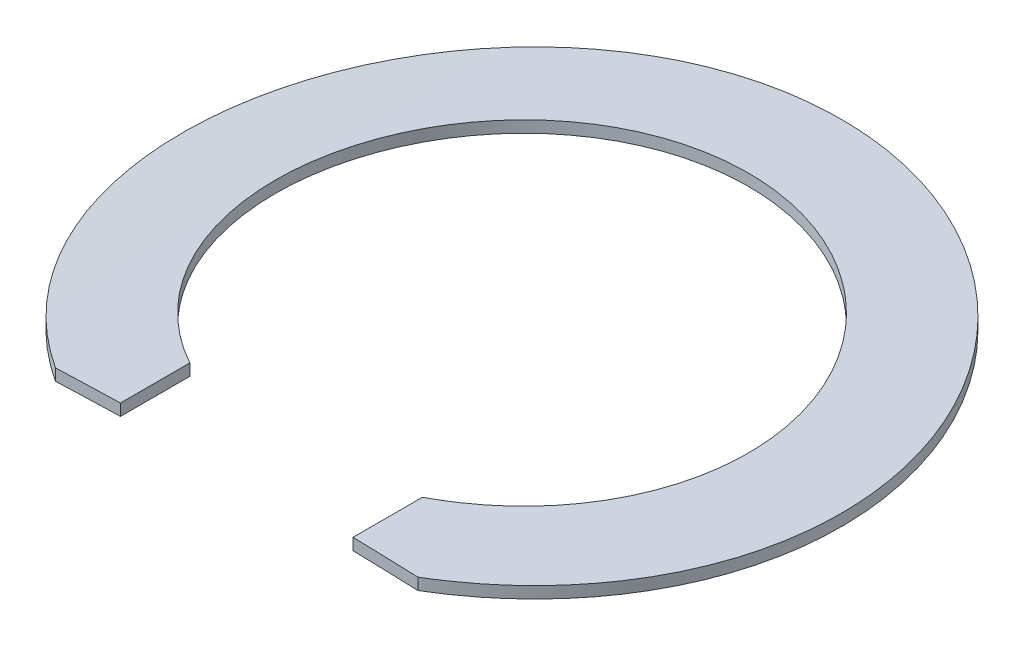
ISO-10303-21;
HEADER;
FILE_DESCRIPTION(('STEP AP214'),'2;1');
FILE_NAME('part.step','',(''),(''),'','','');
FILE_SCHEMA(('AUTOMOTIVE_DESIGN { 1 0 10303 214 1 1 1 1 }'));
ENDSEC;
DATA;
#1=APPLICATION_CONTEXT('core data for automotive mechanical design processes');
#2=APPLICATION_PROTOCOL_DEFINITION('international standard','automotive_design',2000,#1);
#3=PRODUCT_CONTEXT('',#1,'mechanical');
#4=PRODUCT('Part','Part','',(#3));
#5=PRODUCT_RELATED_PRODUCT_CATEGORY('part','',(#4));
#6=PRODUCT_DEFINITION_FORMATION('','',#4);
#7=PRODUCT_DEFINITION_CONTEXT('part definition',#1,'design');
#8=PRODUCT_DEFINITION('design','',#6,#7);
#9=PRODUCT_DEFINITION_SHAPE('','',#8);
#10=(LENGTH_UNIT() NAMED_UNIT(*) SI_UNIT(.MILLI.,.METRE.));
#11=(NAMED_UNIT(*) PLANE_ANGLE_UNIT() SI_UNIT($,.RADIAN.));
#12=(NAMED_UNIT(*) SI_UNIT($,.STERADIAN.) SOLID_ANGLE_UNIT());
#13=UNCERTAINTY_MEASURE_WITH_UNIT(LENGTH_MEASURE(1.E-05),#10,'distance_accuracy_value','');
#14=(GEOMETRIC_REPRESENTATION_CONTEXT(3) GLOBAL_UNCERTAINTY_ASSIGNED_CONTEXT((#13)) GLOBAL_UNIT_ASSIGNED_CONTEXT((#10,
#11,#12)) REPRESENTATION_CONTEXT('',''));
#15=CARTESIAN_POINT('',(0.,0.,0.));
#16=DIRECTION('',(0.,0.,1.));
#17=DIRECTION('',(1.,0.,0.));
#18=AXIS2_PLACEMENT_3D('',#15,#16,#17);
#19=CARTESIAN_POINT('',(0.,-120.2666666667,-8.5));
#20=DIRECTION('',(0.,0.,1.));
#21=DIRECTION('',(1.,0.,0.));
#22=AXIS2_PLACEMENT_3D('',#19,#20,#21);
#23=CYLINDRICAL_SURFACE('',#22,120.8666666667);
#24=CARTESIAN_POINT('',(-4.67332857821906,0.509618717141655,7.10000000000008));
#25=CARTESIAN_POINT('',(-4.87311420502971,0.50189056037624,6.96852828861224));
#26=CARTESIAN_POINT('',(-5.06731171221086,0.49387740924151,6.82859123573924));
#27=CARTESIAN_POINT('',(-5.44321624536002,0.477516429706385,6.53287582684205));
#28=CARTESIAN_POINT('',(-5.62492387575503,0.469168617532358,6.37709823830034));
#29=CARTESIAN_POINT('',(-5.97444272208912,0.452378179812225,6.0508820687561));
#30=CARTESIAN_POINT('',(-6.14226271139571,0.443935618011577,5.88045288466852));
#31=CARTESIAN_POINT('',(-6.46295110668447,0.427190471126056,5.52606212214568));
#32=CARTESIAN_POINT('',(-6.61581968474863,0.418887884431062,5.34210069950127));
#33=CARTESIAN_POINT('',(-6.90559081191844,0.402654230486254,4.96185282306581));
#34=CARTESIAN_POINT('',(-7.04248580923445,0.394723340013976,4.7655606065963));
#35=CARTESIAN_POINT('',(-7.2992546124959,0.379462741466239,4.36211607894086));
#36=CARTESIAN_POINT('',(-7.419128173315,0.372133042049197,4.15496361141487));
#37=CARTESIAN_POINT('',(-7.64097125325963,0.358285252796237,3.73131594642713));
#38=CARTESIAN_POINT('',(-7.74294471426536,0.351766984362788,3.514822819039));
#39=CARTESIAN_POINT('',(-7.92828879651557,0.33972610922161,3.07398892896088));
#40=CARTESIAN_POINT('',(-8.01165951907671,0.334203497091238,2.84964820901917));
#41=CARTESIAN_POINT('',(-8.15912294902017,0.324316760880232,2.39494847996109));
#42=CARTESIAN_POINT('',(-8.22323542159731,0.319951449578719,2.16459590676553));
#43=CARTESIAN_POINT('',(-8.33185478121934,0.312495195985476,1.69920900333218));
#44=CARTESIAN_POINT('',(-8.37635486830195,0.30940469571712,1.46417307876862));
#45=CARTESIAN_POINT('',(-8.44539372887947,0.304588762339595,0.99118313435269));
#46=CARTESIAN_POINT('',(-8.4699332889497,0.302863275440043,0.753229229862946));
#47=CARTESIAN_POINT('',(-8.49887637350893,0.300826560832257,0.276090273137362));
#48=CARTESIAN_POINT('',(-8.50327961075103,0.300515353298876,0.0369052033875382));
#49=CARTESIAN_POINT('',(-8.4919299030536,0.30131527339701,-0.440456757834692));
#50=CARTESIAN_POINT('',(-8.47622128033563,0.302423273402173,-0.678634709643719));
#51=CARTESIAN_POINT('',(-8.42483693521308,0.306024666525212,-1.15282132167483));
#52=CARTESIAN_POINT('',(-8.38916080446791,0.308518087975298,-1.38882993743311));
#53=CARTESIAN_POINT('',(-8.29810959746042,0.314818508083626,-1.85693754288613));
#54=CARTESIAN_POINT('',(-8.24273938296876,0.318625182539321,-2.08903748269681));
#55=CARTESIAN_POINT('',(-8.11267384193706,0.327445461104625,-2.54782117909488));
#56=CARTESIAN_POINT('',(-8.0379718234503,0.332459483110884,-2.77450303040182));
#57=CARTESIAN_POINT('',(-7.86979164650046,0.343550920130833,-3.22075020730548));
#58=CARTESIAN_POINT('',(-7.77631447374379,0.349628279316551,-3.44031590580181));
#59=CARTESIAN_POINT('',(-7.57124699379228,0.362674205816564,-3.87079597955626));
#60=CARTESIAN_POINT('',(-7.45965637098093,0.369642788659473,-4.08171020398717));
#61=CARTESIAN_POINT('',(-7.21915490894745,0.38427373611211,-4.49339909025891));
#62=CARTESIAN_POINT('',(-7.09024384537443,0.391936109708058,-4.69417362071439));
#63=CARTESIAN_POINT('',(-6.81601249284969,0.40773799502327,-5.0841715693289));
#64=CARTESIAN_POINT('',(-6.67069181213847,0.415877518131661,-5.27339471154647));
#65=CARTESIAN_POINT('',(-6.36436471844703,0.432420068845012,-5.63931812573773));
#66=CARTESIAN_POINT('',(-6.20332765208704,0.44082358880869,-5.8159927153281));
#67=CARTESIAN_POINT('',(-5.8668919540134,0.457643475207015,-6.15521435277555));
#68=CARTESIAN_POINT('',(-5.69148836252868,0.46605984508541,-6.31775648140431));
#69=CARTESIAN_POINT('',(-5.3276405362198,0.482662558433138,-6.62746651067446));
#70=CARTESIAN_POINT('',(-5.13919865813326,0.4908489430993,-6.77463717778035));
#71=CARTESIAN_POINT('',(-4.75057436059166,0.506761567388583,-7.05259644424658));
#72=CARTESIAN_POINT('',(-4.55039176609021,0.514487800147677,-7.18338479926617));
#73=CARTESIAN_POINT('',(-4.13953135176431,0.52926735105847,-7.42774918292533));
#74=CARTESIAN_POINT('',(-3.92884487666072,0.536320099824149,-7.54131069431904));
#75=CARTESIAN_POINT('',(-3.49862085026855,0.549545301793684,-7.75028022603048));
#76=CARTESIAN_POINT('',(-3.27908309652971,0.555717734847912,-7.84568783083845));
#77=CARTESIAN_POINT('',(-2.83276424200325,0.567005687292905,-8.01764479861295));
#78=CARTESIAN_POINT('',(-2.60598454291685,0.572121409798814,-8.09419778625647));
#79=CARTESIAN_POINT('',(-2.14667699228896,0.581153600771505,-8.22794080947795));
#80=CARTESIAN_POINT('',(-1.91414718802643,0.585069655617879,-8.28512416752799));
#81=CARTESIAN_POINT('',(-1.44554050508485,0.591582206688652,-8.37958401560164));
#82=CARTESIAN_POINT('',(-1.20947156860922,0.594181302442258,-8.41689972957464));
#83=CARTESIAN_POINT('',(-0.735014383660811,0.597997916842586,-8.47152750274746));
#84=CARTESIAN_POINT('',(-0.496626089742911,0.599215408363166,-8.48883916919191));
#85=CARTESIAN_POINT('',(-0.0192403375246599,0.600234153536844,-8.50333202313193));
#86=CARTESIAN_POINT('',(0.219757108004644,0.600035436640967,-8.5005136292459));
#87=CARTESIAN_POINT('',(0.69666093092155,0.598227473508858,-8.47476775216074));
#88=CARTESIAN_POINT('',(0.934567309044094,0.596618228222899,-8.45184028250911));
#89=CARTESIAN_POINT('',(1.40720614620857,0.592038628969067,-8.38609596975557));
#90=CARTESIAN_POINT('',(1.64194315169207,0.58907050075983,-8.34331164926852));
#91=CARTESIAN_POINT('',(2.10696781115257,0.581857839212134,-8.23817400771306));
#92=CARTESIAN_POINT('',(2.3372555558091,0.577613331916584,-8.17582108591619));
#93=CARTESIAN_POINT('',(2.79179759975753,0.567966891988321,-8.03197992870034));
#94=CARTESIAN_POINT('',(3.01605076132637,0.56256474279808,-7.95048811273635));
#95=CARTESIAN_POINT('',(3.45681736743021,0.550758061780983,-7.76898955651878));
#96=CARTESIAN_POINT('',(3.67333343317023,0.544353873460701,-7.66898915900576));
#97=CARTESIAN_POINT('',(4.09744537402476,0.530713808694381,-7.45103057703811));
#98=CARTESIAN_POINT('',(4.30502975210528,0.523476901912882,-7.33305008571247));
#99=CARTESIAN_POINT('',(4.70952098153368,0.50838245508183,-7.08006460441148));
#100=CARTESIAN_POINT('',(4.90642806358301,0.500524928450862,-6.9450599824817));
#101=CARTESIAN_POINT('',(5.28818819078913,0.48441070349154,-6.65897616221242));
#102=CARTESIAN_POINT('',(5.47304087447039,0.476153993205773,-6.50789648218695));
#103=CARTESIAN_POINT('',(5.82938131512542,0.459474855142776,-6.19073543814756));
#104=CARTESIAN_POINT('',(6.00086926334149,0.451052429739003,-6.02465428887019));
#105=CARTESIAN_POINT('',(6.32965330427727,0.434260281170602,-5.67826045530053));
#106=CARTESIAN_POINT('',(6.48691582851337,0.425890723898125,-5.49791589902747));
#107=CARTESIAN_POINT('',(6.78563694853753,0.409464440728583,-5.12467054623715));
#108=CARTESIAN_POINT('',(6.92710098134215,0.401407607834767,-4.9317741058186));
#109=CARTESIAN_POINT('',(7.19330776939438,0.385831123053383,-4.53469602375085));
#110=CARTESIAN_POINT('',(7.31804741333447,0.37831157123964,-4.33051229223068));
#111=CARTESIAN_POINT('',(7.54988240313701,0.364025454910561,-3.91234297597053));
#112=CARTESIAN_POINT('',(7.65697815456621,0.357258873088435,-3.69835761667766));
#113=CARTESIAN_POINT('',(7.8527513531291,0.344672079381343,-3.26212301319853));
#114=CARTESIAN_POINT('',(7.94143087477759,0.33885176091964,-3.03987470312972));
#115=CARTESIAN_POINT('',(8.09974831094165,0.328322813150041,-2.58867487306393));
#116=CARTESIAN_POINT('',(8.16938655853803,0.323614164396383,-2.35972347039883));
#117=CARTESIAN_POINT('',(8.28913205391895,0.315442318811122,-1.8967028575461));
#118=CARTESIAN_POINT('',(8.33923578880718,0.311979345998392,-1.6626327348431));
#119=CARTESIAN_POINT('',(8.41951777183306,0.306400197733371,-1.1911680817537));
#120=CARTESIAN_POINT('',(8.44970297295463,0.304283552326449,-0.953774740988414));
#121=CARTESIAN_POINT('',(8.4899174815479,0.301458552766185,-0.477748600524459));
#122=CARTESIAN_POINT('',(8.49998626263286,0.30074744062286,-0.239119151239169));
#123=CARTESIAN_POINT('',(8.500013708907,0.300745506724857,0.238135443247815));
#124=CARTESIAN_POINT('',(8.48997284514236,0.301454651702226,0.476760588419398));
#125=CARTESIAN_POINT('',(8.44985593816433,0.30427281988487,0.952295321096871));
#126=CARTESIAN_POINT('',(8.41978130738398,0.306381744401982,1.18920502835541));
#127=CARTESIAN_POINT('',(8.33981600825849,0.311939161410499,1.65963645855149));
#128=CARTESIAN_POINT('',(8.28992563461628,0.315387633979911,1.89315823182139));
#129=CARTESIAN_POINT('',(8.17073809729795,0.323522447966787,2.35496482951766));
#130=CARTESIAN_POINT('',(8.10145718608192,0.328207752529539,2.58325386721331));
#131=CARTESIAN_POINT('',(7.94399497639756,0.338682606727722,3.03310303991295));
#132=CARTESIAN_POINT('',(7.85582019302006,0.344471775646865,3.25466546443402));
#133=CARTESIAN_POINT('',(7.66112159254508,0.356995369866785,3.68972202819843));
#134=CARTESIAN_POINT('',(7.55458581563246,0.363730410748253,3.903210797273));
#135=CARTESIAN_POINT('',(7.32396706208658,0.377951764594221,4.32045409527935));
#136=CARTESIAN_POINT('',(7.19988469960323,0.385438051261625,4.52420896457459));
#137=CARTESIAN_POINT('',(6.93469949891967,0.400970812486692,4.92108245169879));
#138=CARTESIAN_POINT('',(6.79355251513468,0.409018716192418,5.11417151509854));
#139=CARTESIAN_POINT('',(6.49550330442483,0.425428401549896,5.48776205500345));
#140=CARTESIAN_POINT('',(6.33860146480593,0.433790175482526,5.66826384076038));
#141=CARTESIAN_POINT('',(6.0104436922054,0.45057577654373,6.01510398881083));
#142=CARTESIAN_POINT('',(5.8392128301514,0.458999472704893,6.18146610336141));
#143=CARTESIAN_POINT('',(5.48343601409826,0.47568177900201,6.49913416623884));
#144=CARTESIAN_POINT('',(5.29889796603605,0.48394048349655,6.65044892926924));
#145=CARTESIAN_POINT('',(5.03745015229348,0.495000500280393,6.84704188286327));
#146=CARTESIAN_POINT('',(4.96568857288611,0.497973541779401,6.89926205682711));
#147=CARTESIAN_POINT('',(4.82065006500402,0.503850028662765,7.00137016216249));
#148=CARTESIAN_POINT('',(4.7473750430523,0.506753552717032,7.05126079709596));
#149=CARTESIAN_POINT('',(4.67332857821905,0.509618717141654,7.10000000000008));
#150=B_SPLINE_CURVE_WITH_KNOTS('',3,(#24,#25,#26,#27,#28,#29,#30,#31,#32,#33,#34,#35,#36,#37,
#38,#39,#40,#41,#42,#43,#44,#45,#46,#47,#48,#49,#50,#51,#52,#53,#54,#55,#56,#57,#58,#59,#60,#61,
#62,#63,#64,#65,#66,#67,#68,#69,#70,#71,#72,#73,#74,#75,#76,#77,#78,#79,#80,#81,#82,#83,#84,#85,
#86,#87,#88,#89,#90,#91,#92,#93,#94,#95,#96,#97,#98,#99,#100,#101,#102,#103,#104,#105,#106,#107,
#108,#109,#110,#111,#112,#113,#114,#115,#116,#117,#118,#119,#120,#121,#122,#123,#124,#125,#126,
#127,#128,#129,#130,#131,#132,#133,#134,#135,#136,#137,#138,#139,#140,#141,#142,#143,#144,#145,
#146,#147,#148,#149),.UNSPECIFIED.,.F.,.F.,(4,2,2,2,2,2,2,2,2,2,2,2,2,2,2,2,2,2,2,2,2,2,2,2,2,2,
2,2,2,2,2,2,2,2,2,2,2,2,2,2,2,2,2,2,2,2,2,2,2,2,2,2,2,2,2,2,2,2,2,2,2,2,4),(0.,
0.717644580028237,1.43525440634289,2.15240737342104,2.86955208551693,3.58703447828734,
4.30452720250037,5.0218617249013,5.73919234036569,6.45578420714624,7.17262433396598,
7.88943621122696,8.60625831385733,9.32150341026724,10.0367631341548,10.751846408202,
11.4671775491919,12.1824711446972,12.8977772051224,13.6130925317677,14.328424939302,
15.045181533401,15.7621866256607,16.4790624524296,17.1959489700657,17.9134362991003,
18.6309400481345,19.3483057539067,20.0659185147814,20.7821092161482,21.4983139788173,
22.2145038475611,22.9306932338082,23.6457137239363,24.3607196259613,25.0758593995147,
25.7907545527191,26.5065439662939,27.2223179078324,27.9381133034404,28.653898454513,
29.3713308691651,30.0885156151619,30.8058335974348,31.5231350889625,32.2403557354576,
32.9575638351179,33.6749008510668,34.3919873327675,35.1076653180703,35.8233265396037,
36.5389373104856,37.2545374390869,37.9695395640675,38.684295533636,39.3995188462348,
40.1147171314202,40.8318068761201,41.5488789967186,42.264721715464,42.9801425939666,
43.2465103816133,43.5125609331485),.UNSPECIFIED.);
#151=CARTESIAN_POINT('',(-4.67332857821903,0.509618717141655,7.10000000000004));
#152=VERTEX_POINT('',#151);
#153=CARTESIAN_POINT('',(4.67332857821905,0.509618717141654,7.10000000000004));
#154=VERTEX_POINT('',#153);
#155=EDGE_CURVE('E120',#152,#154,#150,.T.);
#156=ORIENTED_EDGE('',*,*,#155,.F.);
#157=CARTESIAN_POINT('',(0.,-120.2666666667,7.1));
#158=DIRECTION('',(0.,0.,1.));
#159=DIRECTION('',(1.,0.,0.));
#160=AXIS2_PLACEMENT_3D('',#157,#158,#159);
#161=CIRCLE('',#160,120.8666666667);
#162=CARTESIAN_POINT('',(-3.,0.562763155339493,7.1));
#163=VERTEX_POINT('',#162);
#164=EDGE_CURVE('E81',#152,#163,#161,.F.);
#165=ORIENTED_EDGE('',*,*,#164,.T.);
#166=DIRECTION('',(0.,0.,1.));
#167=VECTOR('',#166,1.);
#168=CARTESIAN_POINT('',(-3.,0.5627631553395,5.311308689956));
#169=LINE('',#168,#167);
#170=CARTESIAN_POINT('',(-2.99999999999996,0.562763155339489,5.31130868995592));
#171=VERTEX_POINT('',#170);
#172=EDGE_CURVE('E80',#163,#171,#169,.F.);
#173=ORIENTED_EDGE('',*,*,#172,.T.);
#174=CARTESIAN_POINT('',(-2.99999999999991,0.562763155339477,5.31130868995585));
#175=CARTESIAN_POINT('',(-3.14943207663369,0.559054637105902,5.22692562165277));
#176=CARTESIAN_POINT('',(-3.29527874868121,0.555154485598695,5.13620924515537));
#177=CARTESIAN_POINT('',(-3.5788046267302,0.547087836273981,4.94282730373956));
#178=CARTESIAN_POINT('',(-3.71648423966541,0.542921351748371,4.84016233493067));
#179=CARTESIAN_POINT('',(-3.98260397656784,0.53444144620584,4.62366567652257));
#180=CARTESIAN_POINT('',(-4.11105031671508,0.530128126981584,4.50984162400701));
#181=CARTESIAN_POINT('',(-4.35789816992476,0.521474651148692,4.27178188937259));
#182=CARTESIAN_POINT('',(-4.47629979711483,0.517134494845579,4.1475463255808));
#183=CARTESIAN_POINT('',(-4.70225122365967,0.508549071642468,3.88950544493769));
#184=CARTESIAN_POINT('',(-4.80979796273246,0.504303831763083,3.75569744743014));
#185=CARTESIAN_POINT('',(-5.01327579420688,0.496028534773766,3.47944055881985));
#186=CARTESIAN_POINT('',(-5.10920258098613,0.491998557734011,3.33698849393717));
#187=CARTESIAN_POINT('',(-5.28866014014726,0.484272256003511,3.04458269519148));
#188=CARTESIAN_POINT('',(-5.37219795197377,0.480575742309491,2.89463328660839));
#189=CARTESIAN_POINT('',(-5.5263763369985,0.473617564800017,2.58816512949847));
#190=CARTESIAN_POINT('',(-5.59701214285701,0.470356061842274,2.43164397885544));
#191=CARTESIAN_POINT('',(-5.72480565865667,0.464364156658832,2.11329184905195));
#192=CARTESIAN_POINT('',(-5.78197140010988,0.46163343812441,1.95146409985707));
#193=CARTESIAN_POINT('',(-5.88248900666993,0.456777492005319,1.62349931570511));
#194=CARTESIAN_POINT('',(-5.92583576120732,0.45465248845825,1.4573607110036));
#195=CARTESIAN_POINT('',(-5.99836769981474,0.451070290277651,1.12205236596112));
#196=CARTESIAN_POINT('',(-6.02755605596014,0.449612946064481,0.952883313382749));
#197=CARTESIAN_POINT('',(-6.07158438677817,0.447406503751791,0.61261997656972));
#198=CARTESIAN_POINT('',(-6.08641906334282,0.446657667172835,0.441525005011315));
#199=CARTESIAN_POINT('',(-6.10160283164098,0.445891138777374,0.0989584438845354));
#200=CARTESIAN_POINT('',(-6.10197439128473,0.445872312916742,-0.0725121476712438));
#201=CARTESIAN_POINT('',(-6.08828370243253,0.446563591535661,-0.414937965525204));
#202=CARTESIAN_POINT('',(-6.07421612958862,0.447273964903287,-0.58589297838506));
#203=CARTESIAN_POINT('',(-6.03174844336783,0.449403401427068,-0.925934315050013));
#204=CARTESIAN_POINT('',(-6.00335454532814,0.450822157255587,-1.09502141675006));
#205=CARTESIAN_POINT('',(-5.93243018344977,0.454328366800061,-1.43025934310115));
#206=CARTESIAN_POINT('',(-5.88989450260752,0.45641606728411,-1.59640906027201));
#207=CARTESIAN_POINT('',(-5.79101342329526,0.461199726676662,-1.92444169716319));
#208=CARTESIAN_POINT('',(-5.73467633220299,0.463895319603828,-2.08632711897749));
#209=CARTESIAN_POINT('',(-5.60859446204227,0.469818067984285,-2.40479832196));
#210=CARTESIAN_POINT('',(-5.53884474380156,0.473045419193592,-2.56138212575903));
#211=CARTESIAN_POINT('',(-5.31020314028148,0.483390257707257,-3.0213732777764));
#212=CARTESIAN_POINT('',(-5.13181393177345,0.491175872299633,-3.31536711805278));
#213=CARTESIAN_POINT('',(-4.72816994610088,0.507652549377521,-3.86938885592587));
#214=CARTESIAN_POINT('',(-4.50286749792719,0.516344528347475,-4.12938176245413));
#215=CARTESIAN_POINT('',(-4.01180279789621,0.533651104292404,-4.60791700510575));
#216=CARTESIAN_POINT('',(-3.74604059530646,0.542265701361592,-4.82645939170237));
#217=CARTESIAN_POINT('',(-3.18139338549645,0.558453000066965,-5.21598346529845));
#218=CARTESIAN_POINT('',(-2.88248514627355,0.566024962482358,-5.3869314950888));
#219=CARTESIAN_POINT('',(-2.26016605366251,0.579266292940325,-5.6762117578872));
#220=CARTESIAN_POINT('',(-1.93675528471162,0.58493566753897,-5.7945441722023));
#221=CARTESIAN_POINT('',(-1.27485752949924,0.593729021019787,-5.97514329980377));
#222=CARTESIAN_POINT('',(-0.936381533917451,0.596854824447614,-6.03745020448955));
#223=CARTESIAN_POINT('',(-0.253760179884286,0.600215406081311,-6.10436031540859));
#224=CARTESIAN_POINT('',(0.0903851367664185,0.600450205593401,-6.10896394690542));
#225=CARTESIAN_POINT('',(0.774204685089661,0.598003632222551,-6.06036161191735));
#226=CARTESIAN_POINT('',(1.1138831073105,0.595325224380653,-6.00721442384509));
#227=CARTESIAN_POINT('',(1.77948917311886,0.587358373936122,-5.84472199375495));
#228=CARTESIAN_POINT('',(2.10541678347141,0.582069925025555,-5.73537661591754));
#229=CARTESIAN_POINT('',(2.73437342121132,0.569476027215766,-5.46357113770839));
#230=CARTESIAN_POINT('',(3.03739626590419,0.562170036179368,-5.30109675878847));
#231=CARTESIAN_POINT('',(3.61188816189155,0.546362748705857,-4.92763808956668));
#232=CARTESIAN_POINT('',(3.88335701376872,0.537861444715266,-4.71665349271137));
#233=CARTESIAN_POINT('',(4.38733673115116,0.520609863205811,-4.25193755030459));
#234=CARTESIAN_POINT('',(4.61980304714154,0.511859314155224,-3.99815797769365));
#235=CARTESIAN_POINT('',(5.03890934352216,0.495101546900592,-3.45498061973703));
#236=CARTESIAN_POINT('',(5.22554907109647,0.487094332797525,-3.16558263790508));
#237=CARTESIAN_POINT('',(5.46701356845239,0.476322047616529,-2.71133542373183));
#238=CARTESIAN_POINT('',(5.54112178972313,0.472935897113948,-2.55645323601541));
#239=CARTESIAN_POINT('',(5.67602587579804,0.466669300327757,-2.24100424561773));
#240=CARTESIAN_POINT('',(5.7368266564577,0.463788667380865,-2.08043956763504));
#241=CARTESIAN_POINT('',(5.84469700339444,0.458614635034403,-1.75470185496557));
#242=CARTESIAN_POINT('',(5.89176167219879,0.456321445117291,-1.58952719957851));
#243=CARTESIAN_POINT('',(5.97178871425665,0.452389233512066,-1.25585014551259));
#244=CARTESIAN_POINT('',(6.00475631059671,0.450749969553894,-1.08734900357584));
#245=CARTESIAN_POINT('',(6.05635809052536,0.448172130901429,-0.748276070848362));
#246=CARTESIAN_POINT('',(6.07500177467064,0.447233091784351,-0.577705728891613));
#247=CARTESIAN_POINT('',(6.09785465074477,0.446080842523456,-0.235661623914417));
#248=CARTESIAN_POINT('',(6.10206918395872,0.445867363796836,-0.0641882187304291));
#249=CARTESIAN_POINT('',(6.09604713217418,0.446171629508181,0.278567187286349));
#250=CARTESIAN_POINT('',(6.08580522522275,0.446689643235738,0.449849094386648));
#251=CARTESIAN_POINT('',(6.05094075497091,0.448442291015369,0.790875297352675));
#252=CARTESIAN_POINT('',(6.02632350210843,0.449676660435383,0.960620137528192));
#253=CARTESIAN_POINT('',(5.96290067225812,0.452826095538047,1.29736651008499));
#254=CARTESIAN_POINT('',(5.92410035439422,0.454740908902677,1.46436903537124));
#255=CARTESIAN_POINT('',(5.83260453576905,0.459196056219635,1.79444825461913));
#256=CARTESIAN_POINT('',(5.7799141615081,0.461736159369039,1.95752637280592));
#257=CARTESIAN_POINT('',(5.66097965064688,0.467371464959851,2.27873952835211));
#258=CARTESIAN_POINT('',(5.59472920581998,0.470466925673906,2.43687222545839));
#259=CARTESIAN_POINT('',(5.44918860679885,0.477123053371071,2.74693712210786));
#260=CARTESIAN_POINT('',(5.36990324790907,0.480683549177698,2.89887157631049));
#261=CARTESIAN_POINT('',(5.19871823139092,0.48817500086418,3.1957358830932));
#262=CARTESIAN_POINT('',(5.10680097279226,0.49210647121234,3.34065557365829));
#263=CARTESIAN_POINT('',(4.91112762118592,0.500222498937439,3.62218197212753));
#264=CARTESIAN_POINT('',(4.8073758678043,0.504406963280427,3.75879169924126));
#265=CARTESIAN_POINT('',(4.58878070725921,0.512910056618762,4.02274038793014));
#266=CARTESIAN_POINT('',(4.47394144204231,0.517228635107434,4.15008278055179));
#267=CARTESIAN_POINT('',(4.23399604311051,0.525877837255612,4.39461292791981));
#268=CARTESIAN_POINT('',(4.10889291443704,0.530208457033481,4.51180363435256));
#269=CARTESIAN_POINT('',(3.82755878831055,0.539474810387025,4.75391494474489));
#270=CARTESIAN_POINT('',(3.66961859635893,0.544390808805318,4.87685764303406));
#271=CARTESIAN_POINT('',(3.34272172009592,0.553878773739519,5.10648262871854));
#272=CARTESIAN_POINT('',(3.17378413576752,0.558451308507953,5.21319208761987));
#273=CARTESIAN_POINT('',(2.99999999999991,0.562763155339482,5.31130868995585));
#274=B_SPLINE_CURVE_WITH_KNOTS('',3,(#174,#175,#176,#177,#178,#179,#180,#181,#182,#183,#184,
#185,#186,#187,#188,#189,#190,#191,#192,#193,#194,#195,#196,#197,#198,#199,#200,#201,#202,#203,
#204,#205,#206,#207,#208,#209,#210,#211,#212,#213,#214,#215,#216,#217,#218,#219,#220,#221,#222,
#223,#224,#225,#226,#227,#228,#229,#230,#231,#232,#233,#234,#235,#236,#237,#238,#239,#240,#241,
#242,#243,#244,#245,#246,#247,#248,#249,#250,#251,#252,#253,#254,#255,#256,#257,#258,#259,#260,
#261,#262,#263,#264,#265,#266,#267,#268,#269,#270,#271,#272,#273),.UNSPECIFIED.,.F.,.F.,(4,2,2,
2,2,2,2,2,2,2,2,2,2,2,2,2,2,2,2,2,2,2,2,2,2,2,2,2,2,2,2,2,2,2,2,2,2,2,2,2,2,2,2,2,2,2,2,2,2,4),
(0.,0.514796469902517,1.02956726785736,1.54398819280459,2.05840327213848,2.57296297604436,
3.08771276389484,3.60216893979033,4.11681482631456,4.63115307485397,5.14568131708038,
5.66009423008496,6.17469694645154,6.68850021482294,7.20249301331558,7.7162630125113,
8.23022275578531,8.7438738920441,9.25771454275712,10.2843226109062,11.311979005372,
12.339634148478,13.3680141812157,14.3963906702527,15.424028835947,16.4516594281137,
17.4782450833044,18.5048332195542,19.5316974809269,20.558568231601,21.5866040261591,
22.6146454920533,23.1293409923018,23.6438460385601,24.1585343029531,24.6730317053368,
25.1871875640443,25.7011530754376,26.2153078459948,26.7292728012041,27.2430473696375,
27.7566325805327,28.2704572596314,28.7840933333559,29.2984524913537,29.8126236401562,
30.3266034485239,30.840433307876,31.4400803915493,32.0387124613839),.UNSPECIFIED.);
#275=CARTESIAN_POINT('',(2.99999999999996,0.562763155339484,5.31130868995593));
#276=VERTEX_POINT('',#275);
#277=EDGE_CURVE('E20',#171,#276,#274,.T.);
#278=ORIENTED_EDGE('',*,*,#277,.T.);
#279=DIRECTION('',(0.,0.,-1.));
#280=VECTOR('',#279,1.);
#281=CARTESIAN_POINT('',(3.,0.5627631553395,7.1));
#282=LINE('',#281,#280);
#283=CARTESIAN_POINT('',(3.,0.562763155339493,7.1));
#284=VERTEX_POINT('',#283);
#285=EDGE_CURVE('E92',#276,#284,#282,.F.);
#286=ORIENTED_EDGE('',*,*,#285,.T.);
#287=CARTESIAN_POINT('',(0.,-120.2666666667,7.1));
#288=DIRECTION('',(0.,0.,1.));
#289=DIRECTION('',(1.,0.,0.));
#290=AXIS2_PLACEMENT_3D('',#287,#288,#289);
#291=CIRCLE('',#290,120.8666666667);
#292=EDGE_CURVE('E126',#284,#154,#291,.F.);
#293=ORIENTED_EDGE('',*,*,#292,.T.);
#294=EDGE_LOOP('',(#156,#165,#173,#278,#286,#293));
#295=FACE_BOUND('',#294,.T.);
#296=ADVANCED_FACE('F16',(#295),#23,.T.);
#297=CARTESIAN_POINT('',(0.,0.,0.));
#298=DIRECTION('',(0.,-1.,0.));
#299=DIRECTION('',(0.,0.,-1.));
#300=AXIS2_PLACEMENT_3D('',#297,#298,#299);
#301=CYLINDRICAL_SURFACE('',#300,6.1);
#302=DIRECTION('',(0.,1.,0.));
#303=VECTOR('',#302,1.);
#304=CARTESIAN_POINT('',(-3.,0.6602681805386,5.311308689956));
#305=LINE('',#304,#303);
#306=CARTESIAN_POINT('',(-2.99999999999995,0.262670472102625,5.31130868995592));
#307=VERTEX_POINT('',#306);
#308=EDGE_CURVE('E74',#171,#307,#305,.F.);
#309=ORIENTED_EDGE('',*,*,#308,.T.);
#310=CARTESIAN_POINT('',(-2.99999999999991,0.262670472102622,5.31130868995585));
#311=CARTESIAN_POINT('',(-3.14943228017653,0.258952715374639,5.22692550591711));
#312=CARTESIAN_POINT('',(-3.29527912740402,0.255042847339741,5.13620900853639));
#313=CARTESIAN_POINT('',(-3.57880530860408,0.246956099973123,4.94282681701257));
#314=CARTESIAN_POINT('',(-3.71648504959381,0.242779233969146,4.84016171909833));
#315=CARTESIAN_POINT('',(-3.98260502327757,0.234278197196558,4.62366478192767));
#316=CARTESIAN_POINT('',(-4.11105147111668,0.229954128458,4.50984057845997));
#317=CARTESIAN_POINT('',(-4.35789951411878,0.22127908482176,4.27178052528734));
#318=CARTESIAN_POINT('',(-4.47630122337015,0.216928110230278,4.14754479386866));
#319=CARTESIAN_POINT('',(-4.70225279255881,0.208321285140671,3.88950355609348));
#320=CARTESIAN_POINT('',(-4.80979959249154,0.204065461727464,3.75569536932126));
#321=CARTESIAN_POINT('',(-5.01327753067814,0.195769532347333,3.47943806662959));
#322=CARTESIAN_POINT('',(-5.10920436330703,0.191729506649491,3.33698577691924));
#323=CARTESIAN_POINT('',(-5.28866199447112,0.183983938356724,3.04457948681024));
#324=CARTESIAN_POINT('',(-5.37219983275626,0.180278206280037,2.89462981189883));
#325=CARTESIAN_POINT('',(-5.52637824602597,0.173302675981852,2.5881610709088));
#326=CARTESIAN_POINT('',(-5.59701405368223,0.17003303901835,2.43163960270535));
#327=CARTESIAN_POINT('',(-5.72480745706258,0.164026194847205,2.11328698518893));
#328=CARTESIAN_POINT('',(-5.78197310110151,0.161288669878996,1.95145907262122));
#329=CARTESIAN_POINT('',(-5.88249049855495,0.156420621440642,1.62349392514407));
#330=CARTESIAN_POINT('',(-5.92583714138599,0.1542903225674,1.45735512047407));
#331=CARTESIAN_POINT('',(-5.99836882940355,0.150699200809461,1.1220463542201));
#332=CARTESIAN_POINT('',(-6.02755704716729,0.149238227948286,0.952877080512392));
#333=CARTESIAN_POINT('',(-6.07158506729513,0.147026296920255,0.612613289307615));
#334=CARTESIAN_POINT('',(-6.08641957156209,0.146275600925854,0.441518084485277));
#335=CARTESIAN_POINT('',(-6.1016029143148,0.145507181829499,0.0989520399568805));
#336=CARTESIAN_POINT('',(-6.10197430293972,0.145488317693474,-0.0725177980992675));
#337=CARTESIAN_POINT('',(-6.08828339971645,0.146181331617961,-0.414942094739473));
#338=CARTESIAN_POINT('',(-6.07421578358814,0.146893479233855,-0.585896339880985));
#339=CARTESIAN_POINT('',(-6.03174814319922,0.149028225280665,-0.92593612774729));
#340=CARTESIAN_POINT('',(-6.00335433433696,0.150450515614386,-1.09502244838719));
#341=CARTESIAN_POINT('',(-5.93243028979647,0.153965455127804,-1.43025880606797));
#342=CARTESIAN_POINT('',(-5.88989483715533,0.156058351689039,-1.59640773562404));
#343=CARTESIAN_POINT('',(-5.79101442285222,0.160853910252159,-1.92443859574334));
#344=CARTESIAN_POINT('',(-5.7346777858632,0.163556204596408,-2.08632303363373));
#345=CARTESIAN_POINT('',(-5.60859700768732,0.169493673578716,-2.40479230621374));
#346=CARTESIAN_POINT('',(-5.53884792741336,0.172729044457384,-2.5613751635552));
#347=CARTESIAN_POINT('',(-5.31020851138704,0.183099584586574,-3.02136358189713));
#348=CARTESIAN_POINT('',(-5.13182113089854,0.190904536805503,-3.31535572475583));
#349=CARTESIAN_POINT('',(-4.72818040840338,0.207422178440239,-3.86937601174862));
#350=CARTESIAN_POINT('',(-4.50287915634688,0.216135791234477,-4.12936898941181));
#351=CARTESIAN_POINT('',(-4.01181689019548,0.233485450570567,-4.60790468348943));
#352=CARTESIAN_POINT('',(-3.74605592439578,0.242121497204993,-4.82644744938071));
#353=CARTESIAN_POINT('',(-3.18141005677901,0.258349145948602,-5.2159733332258));
#354=CARTESIAN_POINT('',(-2.88250180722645,0.26594000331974,-5.38692262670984));
#355=CARTESIAN_POINT('',(-2.2601822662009,0.279214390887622,-5.67620534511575));
#356=CARTESIAN_POINT('',(-1.9367710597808,0.284897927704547,-5.79453895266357));
#357=CARTESIAN_POINT('',(-1.27487322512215,0.293713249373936,-5.97513993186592));
#358=CARTESIAN_POINT('',(-0.936397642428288,0.296846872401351,-6.03744769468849));
#359=CARTESIAN_POINT('',(-0.253776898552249,0.30021590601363,-6.10435960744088));
#360=CARTESIAN_POINT('',(0.0903682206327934,0.300451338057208,-6.10896418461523));
#361=CARTESIAN_POINT('',(0.774185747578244,0.297998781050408,-6.06036392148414));
#362=CARTESIAN_POINT('',(1.11386236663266,0.29531377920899,-6.00721815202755));
#363=CARTESIAN_POINT('',(1.77946505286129,0.287327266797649,-5.84472921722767));
#364=CARTESIAN_POINT('',(2.1053910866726,0.282025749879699,-5.73538591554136));
#365=CARTESIAN_POINT('',(2.73434536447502,0.269400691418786,-5.46358506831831));
#366=CARTESIAN_POINT('',(3.03736739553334,0.262076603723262,-5.30111317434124));
#367=CARTESIAN_POINT('',(3.6118581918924,0.246230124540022,-4.92765992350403));
#368=CARTESIAN_POINT('',(3.88332675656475,0.237707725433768,-4.71667825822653));
#369=CARTESIAN_POINT('',(4.3873080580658,0.220413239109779,-4.25196712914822));
#370=CARTESIAN_POINT('',(4.61977602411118,0.211640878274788,-3.99818919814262));
#371=CARTESIAN_POINT('',(5.03888593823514,0.194841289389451,-3.45501475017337));
#372=CARTESIAN_POINT('',(5.22552763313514,0.18681406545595,-3.16561803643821));
#373=CARTESIAN_POINT('',(5.46699535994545,0.176014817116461,-2.71137215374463));
#374=CARTESIAN_POINT('',(5.54110473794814,0.172620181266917,-2.55649021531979));
#375=CARTESIAN_POINT('',(5.67601114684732,0.166337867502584,-2.24104157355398));
#376=CARTESIAN_POINT('',(5.73681309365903,0.163450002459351,-2.08047699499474));
#377=CARTESIAN_POINT('',(5.84468576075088,0.158262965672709,-1.75473933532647));
#378=CARTESIAN_POINT('',(5.89175158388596,0.155964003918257,-1.58956463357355));
#379=CARTESIAN_POINT('',(5.97178090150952,0.152021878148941,-1.25588734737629));
#380=CARTESIAN_POINT('',(6.00474961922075,0.150378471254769,-1.08738601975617));
#381=CARTESIAN_POINT('',(6.05635345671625,0.14779410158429,-0.748313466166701));
#382=CARTESIAN_POINT('',(6.07499815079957,0.146852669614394,-0.577743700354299));
#383=CARTESIAN_POINT('',(6.09785312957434,0.145697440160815,-0.235700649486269));
#384=CARTESIAN_POINT('',(6.10206875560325,0.145483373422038,-0.0642277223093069));
#385=CARTESIAN_POINT('',(6.09604896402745,0.145788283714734,0.27852681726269));
#386=CARTESIAN_POINT('',(6.08580822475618,0.146307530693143,0.449808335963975));
#387=CARTESIAN_POINT('',(6.05094615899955,0.148064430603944,0.790833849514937));
#388=CARTESIAN_POINT('',(6.02633014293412,0.149301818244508,0.960578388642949));
#389=CARTESIAN_POINT('',(5.96290996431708,0.152458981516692,1.29732365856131));
#390=CARTESIAN_POINT('',(5.92411111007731,0.154378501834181,1.46432539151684));
#391=CARTESIAN_POINT('',(5.83261838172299,0.158844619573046,1.79440314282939));
#392=CARTESIAN_POINT('',(5.7799296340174,0.161390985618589,1.95748058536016));
#393=CARTESIAN_POINT('',(5.66099853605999,0.167040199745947,2.27869252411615));
#394=CARTESIAN_POINT('',(5.59474987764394,0.170143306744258,2.43682468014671));
#395=CARTESIAN_POINT('',(5.44921300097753,0.176815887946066,2.74688865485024));
#396=CARTESIAN_POINT('',(5.36992957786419,0.180385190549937,2.89882272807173));
#397=CARTESIAN_POINT('',(5.19874826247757,0.187895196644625,3.19568699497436));
#398=CARTESIAN_POINT('',(5.10683272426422,0.191836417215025,3.34060700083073));
#399=CARTESIAN_POINT('',(4.91116284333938,0.199972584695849,3.62213418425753));
#400=CARTESIAN_POINT('',(4.80741284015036,0.204167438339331,3.75874438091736));
#401=CARTESIAN_POINT('',(4.58882117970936,0.212691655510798,4.02269419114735));
#402=CARTESIAN_POINT('',(4.47398366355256,0.217020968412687,4.15003723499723));
#403=CARTESIAN_POINT('',(4.2340417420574,0.225691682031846,4.39456887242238));
#404=CARTESIAN_POINT('',(4.10894034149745,0.230033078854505,4.51176041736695));
#405=CARTESIAN_POINT('',(3.82760113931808,0.239322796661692,4.7538812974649));
#406=CARTESIAN_POINT('',(3.66965338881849,0.244251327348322,4.87683190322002));
#407=CARTESIAN_POINT('',(3.34274005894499,0.253763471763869,5.10647104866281));
#408=CARTESIAN_POINT('',(3.17379358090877,0.258347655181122,5.21318676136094));
#409=CARTESIAN_POINT('',(2.99999999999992,0.262670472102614,5.31130868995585));
#410=B_SPLINE_CURVE_WITH_KNOTS('',3,(#310,#311,#312,#313,#314,#315,#316,#317,#318,#319,#320,
#321,#322,#323,#324,#325,#326,#327,#328,#329,#330,#331,#332,#333,#334,#335,#336,#337,#338,#339,
#340,#341,#342,#343,#344,#345,#346,#347,#348,#349,#350,#351,#352,#353,#354,#355,#356,#357,#358,
#359,#360,#361,#362,#363,#364,#365,#366,#367,#368,#369,#370,#371,#372,#373,#374,#375,#376,#377,
#378,#379,#380,#381,#382,#383,#384,#385,#386,#387,#388,#389,#390,#391,#392,#393,#394,#395,#396,
#397,#398,#399,#400,#401,#402,#403,#404,#405,#406,#407,#408,#409),.UNSPECIFIED.,.F.,.F.,(4,2,2,
2,2,2,2,2,2,2,2,2,2,2,2,2,2,2,2,2,2,2,2,2,2,2,2,2,2,2,2,2,2,2,2,2,2,2,2,2,2,2,2,2,2,2,2,2,2,4),
(0.,0.514797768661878,1.02956986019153,1.54399213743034,2.05840857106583,2.57296961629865,
3.08772074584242,3.60217825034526,4.1168254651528,4.63116439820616,5.14569332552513,
5.66010690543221,6.17471028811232,6.6885112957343,7.20250183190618,7.71626956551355,
8.23022704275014,8.74387526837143,9.25771300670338,10.2843152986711,11.3119711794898,
12.3396258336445,13.3680089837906,14.3963885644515,15.4240261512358,16.4516561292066,
17.4782359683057,18.5048182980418,19.5316781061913,20.5585444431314,21.586581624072,
22.6146244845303,23.1293213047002,23.6438276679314,24.1585172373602,24.673015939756,
25.1871704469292,25.7011346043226,26.2152880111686,26.7292516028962,27.2430230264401,
27.7566050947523,28.2704266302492,28.7840595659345,29.2984174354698,29.8125873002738,
30.3265658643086,30.8403944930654,31.44007479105,32.0387400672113),.UNSPECIFIED.);
#411=CARTESIAN_POINT('',(3.,0.26267047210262,5.3113086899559));
#412=VERTEX_POINT('',#411);
#413=EDGE_CURVE('E84',#307,#412,#410,.T.);
#414=ORIENTED_EDGE('',*,*,#413,.T.);
#415=DIRECTION('',(0.,1.,0.));
#416=VECTOR('',#415,1.);
#417=CARTESIAN_POINT('',(3.,0.6602681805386,5.311308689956));
#418=LINE('',#417,#416);
#419=EDGE_CURVE('E75',#412,#276,#418,.T.);
#420=ORIENTED_EDGE('',*,*,#419,.T.);
#421=ORIENTED_EDGE('',*,*,#277,.F.);
#422=EDGE_LOOP('',(#309,#414,#420,#421));
#423=FACE_BOUND('',#422,.T.);
#424=ADVANCED_FACE('F72',(#423),#301,.F.);
#425=CARTESIAN_POINT('',(3.,0.6602681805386,7.1));
#426=DIRECTION('',(1.,0.,0.));
#427=DIRECTION('',(0.,0.,-1.));
#428=AXIS2_PLACEMENT_3D('',#425,#426,#427);
#429=PLANE('',#428);
#430=ORIENTED_EDGE('',*,*,#419,.F.);
#431=DIRECTION('',(0.,0.,1.));
#432=VECTOR('',#431,1.);
#433=CARTESIAN_POINT('',(3.,0.262670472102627,-8.5));
#434=LINE('',#433,#432);
#435=CARTESIAN_POINT('',(3.,0.26267047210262,7.1));
#436=VERTEX_POINT('',#435);
#437=EDGE_CURVE('E86',#412,#436,#434,.T.);
#438=ORIENTED_EDGE('',*,*,#437,.T.);
#439=DIRECTION('',(0.,1.,0.));
#440=VECTOR('',#439,1.);
#441=CARTESIAN_POINT('',(3.,0.6602681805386,7.1));
#442=LINE('',#441,#440);
#443=EDGE_CURVE('E94',#436,#284,#442,.T.);
#444=ORIENTED_EDGE('',*,*,#443,.T.);
#445=ORIENTED_EDGE('',*,*,#285,.F.);
#446=EDGE_LOOP('',(#430,#438,#444,#445));
#447=FACE_BOUND('',#446,.T.);
#448=ADVANCED_FACE('F176',(#447),#429,.F.);
#449=CARTESIAN_POINT('',(4.673328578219,0.6602681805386,7.1));
#450=DIRECTION('',(0.,0.,-1.));
#451=DIRECTION('',(-1.,0.,0.));
#452=AXIS2_PLACEMENT_3D('',#449,#450,#451);
#453=PLANE('',#452);
#454=ORIENTED_EDGE('',*,*,#443,.F.);
#455=CARTESIAN_POINT('',(0.,-120.2666666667,7.1));
#456=DIRECTION('',(0.,0.,1.));
#457=DIRECTION('',(1.,0.,0.));
#458=AXIS2_PLACEMENT_3D('',#455,#456,#457);
#459=CIRCLE('',#458,120.5666666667);
#460=CARTESIAN_POINT('',(4.67332857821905,0.209393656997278,7.10000000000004));
#461=VERTEX_POINT('',#460);
#462=EDGE_CURVE('E105',#436,#461,#459,.F.);
#463=ORIENTED_EDGE('',*,*,#462,.T.);
#464=DIRECTION('',(0.,-1.,0.));
#465=VECTOR('',#464,1.);
#466=CARTESIAN_POINT('',(4.67332857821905,0.,7.10000000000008));
#467=LINE('',#466,#465);
#468=EDGE_CURVE('E125',#154,#461,#467,.T.);
#469=ORIENTED_EDGE('',*,*,#468,.F.);
#470=ORIENTED_EDGE('',*,*,#292,.F.);
#471=EDGE_LOOP('',(#454,#463,#469,#470));
#472=FACE_BOUND('',#471,.T.);
#473=ADVANCED_FACE('F115',(#472),#453,.F.);
#474=CARTESIAN_POINT('',(0.,0.,0.));
#475=DIRECTION('',(0.,-1.,0.));
#476=DIRECTION('',(0.,0.,-1.));
#477=AXIS2_PLACEMENT_3D('',#474,#475,#476);
#478=CYLINDRICAL_SURFACE('',#477,8.5);
#479=ORIENTED_EDGE('',*,*,#155,.T.);
#480=ORIENTED_EDGE('',*,*,#468,.T.);
#481=CARTESIAN_POINT('',(4.67332857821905,0.209393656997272,7.10000000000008));
#482=CARTESIAN_POINT('',(4.87311461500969,0.201646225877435,6.96852801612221));
#483=CARTESIAN_POINT('',(5.06731247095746,0.193613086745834,6.82859068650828));
#484=CARTESIAN_POINT('',(5.44321760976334,0.177211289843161,6.53287470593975));
#485=CARTESIAN_POINT('',(5.62492549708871,0.168842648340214,6.37709682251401));
#486=CARTESIAN_POINT('',(5.97444485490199,0.152010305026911,6.0508799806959));
#487=CARTESIAN_POINT('',(6.14226509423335,0.143546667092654,5.88045041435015));
#488=CARTESIAN_POINT('',(6.46295394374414,0.126759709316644,5.52605882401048));
#489=CARTESIAN_POINT('',(6.61582272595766,0.118436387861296,5.3420969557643));
#490=CARTESIAN_POINT('',(6.90559423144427,0.102162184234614,4.96184808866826));
#491=CARTESIAN_POINT('',(7.04248940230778,0.0942114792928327,4.76555532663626));
#492=CARTESIAN_POINT('',(7.29925851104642,0.0789127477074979,4.36210958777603));
#493=CARTESIAN_POINT('',(7.41913220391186,0.0715647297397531,4.15495645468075));
#494=CARTESIAN_POINT('',(7.64097547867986,0.0576823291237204,3.73130733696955));
#495=CARTESIAN_POINT('',(7.74294900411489,0.0511477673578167,3.51481342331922));
#496=CARTESIAN_POINT('',(7.92829312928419,0.0390767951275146,3.07397781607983));
#497=CARTESIAN_POINT('',(8.01166383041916,0.0335403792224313,2.84963616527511));
#498=CARTESIAN_POINT('',(8.15912677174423,0.023628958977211,2.39493544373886));
#499=CARTESIAN_POINT('',(8.22323886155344,0.0192527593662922,2.16458283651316));
#500=CARTESIAN_POINT('',(8.33185747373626,0.011777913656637,1.69919579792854));
#501=CARTESIAN_POINT('',(8.37635719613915,0.00867971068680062,1.4641597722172));
#502=CARTESIAN_POINT('',(8.44539531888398,0.0038517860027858,0.991169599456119));
#503=CARTESIAN_POINT('',(8.46993450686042,0.00212201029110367,0.753215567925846));
#504=CARTESIAN_POINT('',(8.4988768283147,8.02562758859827E-05,0.276076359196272));
#505=CARTESIAN_POINT('',(8.50327967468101,-0.000231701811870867,0.0368911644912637));
#506=CARTESIAN_POINT('',(8.49192922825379,0.000570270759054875,-0.440468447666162));
#507=CARTESIAN_POINT('',(8.47622047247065,0.0016810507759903,-0.678643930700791));
#508=CARTESIAN_POINT('',(8.42483628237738,0.00529143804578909,-1.15282558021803));
#509=CARTESIAN_POINT('',(8.38916043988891,0.00779107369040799,-1.3888317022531));
#510=CARTESIAN_POINT('',(8.29811024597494,0.0141071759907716,-1.856934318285));
#511=CARTESIAN_POINT('',(8.24274075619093,0.0179233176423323,-2.08903176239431));
#512=CARTESIAN_POINT('',(8.11267711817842,0.0267655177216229,-2.54781049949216));
#513=CARTESIAN_POINT('',(8.03797627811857,0.031791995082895,-2.77448988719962));
#514=CARTESIAN_POINT('',(7.86979887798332,0.0429109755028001,-3.22073234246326));
#515=CARTESIAN_POINT('',(7.77632329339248,0.0490034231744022,-3.44029577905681));
#516=CARTESIAN_POINT('',(7.57125943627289,0.062081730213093,-3.87077147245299));
#517=CARTESIAN_POINT('',(7.45967084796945,0.0690676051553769,-4.08168357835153));
#518=CARTESIAN_POINT('',(7.21917388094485,0.0837348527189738,-4.49336845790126));
#519=CARTESIAN_POINT('',(7.09026527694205,0.0914162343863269,-4.69414109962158));
#520=CARTESIAN_POINT('',(6.81603923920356,0.10725731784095,-5.08413557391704));
#521=CARTESIAN_POINT('',(6.67072141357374,0.11541703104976,-5.27335713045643));
#522=CARTESIAN_POINT('',(6.36439870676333,0.132000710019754,-5.63927974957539));
#523=CARTESIAN_POINT('',(6.20336300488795,0.140425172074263,-5.81595498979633));
#524=CARTESIAN_POINT('',(5.86693000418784,0.157286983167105,-6.15517806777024));
#525=CARTESIAN_POINT('',(5.6915277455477,0.165724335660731,-6.31772098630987));
#526=CARTESIAN_POINT('',(5.32768249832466,0.182368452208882,-6.62743276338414));
#527=CARTESIAN_POINT('',(5.13924186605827,0.190575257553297,-6.77460438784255));
#528=CARTESIAN_POINT('',(4.75061992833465,0.206527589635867,-7.05256573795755));
#529=CARTESIAN_POINT('',(4.5504384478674,0.214273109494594,-7.18335521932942));
#530=CARTESIAN_POINT('',(4.13957920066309,0.229089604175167,-7.42772254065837));
#531=CARTESIAN_POINT('',(3.92889273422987,0.236160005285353,-7.541285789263));
#532=CARTESIAN_POINT('',(3.49866843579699,0.249418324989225,-7.75025877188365));
#533=CARTESIAN_POINT('',(3.27913040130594,0.255606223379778,-7.84566809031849));
#534=CARTESIAN_POINT('',(2.83281070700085,0.266922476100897,-8.01762841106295));
#535=CARTESIAN_POINT('',(2.60603044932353,0.272051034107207,-8.09418303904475));
#536=CARTESIAN_POINT('',(2.14672151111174,0.281105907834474,-8.22792922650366));
#537=CARTESIAN_POINT('',(1.91419087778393,0.285031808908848,-8.28511410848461));
#538=CARTESIAN_POINT('',(1.44558440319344,0.291560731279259,-8.37957641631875));
#539=CARTESIAN_POINT('',(1.2095165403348,0.294166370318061,-8.41689324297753));
#540=CARTESIAN_POINT('',(0.735061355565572,0.297992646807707,-8.47152340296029));
#541=CARTESIAN_POINT('',(0.496673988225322,0.299213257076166,-8.48883634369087));
#542=CARTESIAN_POINT('',(0.0192899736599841,0.300234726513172,-8.50333188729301));
#543=CARTESIAN_POINT('',(-0.219706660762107,0.300035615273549,-8.50051490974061));
#544=CARTESIAN_POINT('',(-0.696608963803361,0.298223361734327,-8.47477200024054));
#545=CARTESIAN_POINT('',(-0.934514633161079,0.296610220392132,-8.45184608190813));
#546=CARTESIAN_POINT('',(-1.40715019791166,0.292019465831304,-8.38610527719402));
#547=CARTESIAN_POINT('',(-1.64188466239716,0.289044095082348,-8.34332307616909));
#548=CARTESIAN_POINT('',(-2.10690439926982,0.281813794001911,-8.23819014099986));
#549=CARTESIAN_POINT('',(-2.33718976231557,0.277558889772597,-8.17583980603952));
#550=CARTESIAN_POINT('',(-2.79172724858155,0.267888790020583,-8.03200429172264));
#551=CARTESIAN_POINT('',(-3.01597823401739,0.262473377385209,-7.9505155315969));
#552=CARTESIAN_POINT('',(-3.45674075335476,0.25063767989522,-7.76902354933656));
#553=CARTESIAN_POINT('',(-3.67325490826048,0.244217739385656,-7.6690266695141));
#554=CARTESIAN_POINT('',(-4.0973644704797,0.230544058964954,-7.45107500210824));
#555=CARTESIAN_POINT('',(-4.30494833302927,0.223289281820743,-7.33309781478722));
#556=CARTESIAN_POINT('',(-4.70943883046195,0.208157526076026,-7.08011917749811));
#557=CARTESIAN_POINT('',(-4.90634569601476,0.200280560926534,-6.94511809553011));
#558=CARTESIAN_POINT('',(-5.28810576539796,0.18412643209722,-6.6590415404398));
#559=CARTESIAN_POINT('',(-5.47295860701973,0.175849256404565,-6.50796558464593));
#560=CARTESIAN_POINT('',(-5.82929978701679,0.159128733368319,-6.19081212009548));
#561=CARTESIAN_POINT('',(-6.00078831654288,0.150685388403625,-6.02473482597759));
#562=CARTESIAN_POINT('',(-6.32957573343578,0.133851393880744,-5.6783469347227));
#563=CARTESIAN_POINT('',(-6.48684089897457,0.125460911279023,-5.49800431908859));
#564=CARTESIAN_POINT('',(-6.78556746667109,0.108993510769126,-5.12476256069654));
#565=CARTESIAN_POINT('',(-6.92703430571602,0.100916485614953,-4.93186777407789));
#566=CARTESIAN_POINT('',(-7.19324685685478,0.0853009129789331,-4.5347926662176));
#567=CARTESIAN_POINT('',(-7.31798945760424,0.077762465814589,-4.33061025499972));
#568=CARTESIAN_POINT('',(-7.54983047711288,0.0634404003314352,-3.91244320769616));
#569=CARTESIAN_POINT('',(-7.65692930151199,0.0566567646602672,-3.69845879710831));
#570=CARTESIAN_POINT('',(-7.852708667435,0.0440381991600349,-3.26222580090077));
#571=CARTESIAN_POINT('',(-7.94139129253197,0.0382031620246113,-3.03997815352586));
#572=CARTESIAN_POINT('',(-8.09971496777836,0.0276475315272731,-2.58877925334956));
#573=CARTESIAN_POINT('',(-8.16935635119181,0.0229269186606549,-2.35982811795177));
#574=CARTESIAN_POINT('',(-8.28910809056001,0.0147342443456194,-1.89680766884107));
#575=CARTESIAN_POINT('',(-8.33921493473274,0.0112624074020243,-1.6627374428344));
#576=CARTESIAN_POINT('',(-8.41950305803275,0.00566889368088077,-1.19127223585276));
#577=CARTESIAN_POINT('',(-8.44969129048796,0.00354674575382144,-0.953878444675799));
#578=CARTESIAN_POINT('',(-8.4899115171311,0.000714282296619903,-0.477853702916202));
#579=CARTESIAN_POINT('',(-8.49998320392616,1.1865498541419E-06,-0.239226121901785));
#580=CARTESIAN_POINT('',(-8.5000167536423,-1.18354651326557E-06,0.238024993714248));
#581=CARTESIAN_POINT('',(-8.48997908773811,0.0007095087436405,0.47664852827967));
#582=CARTESIAN_POINT('',(-8.44986885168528,0.00353425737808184,0.952180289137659));
#583=CARTESIAN_POINT('',(-8.41979769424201,0.00564821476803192,1.18908863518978));
#584=CARTESIAN_POINT('',(-8.33983960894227,0.0112190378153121,1.65951759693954));
#585=CARTESIAN_POINT('',(-8.28995297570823,0.0146758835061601,1.8930382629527));
#586=CARTESIAN_POINT('',(-8.17077343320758,0.0228305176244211,2.35484192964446));
#587=CARTESIAN_POINT('',(-8.10149685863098,0.027527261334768,2.58312916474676));
#588=CARTESIAN_POINT('',(-7.9440437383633,0.0380277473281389,3.03297508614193));
#589=CARTESIAN_POINT('',(-7.85587370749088,0.0438311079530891,3.25453606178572));
#590=CARTESIAN_POINT('',(-7.66118501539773,0.0563854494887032,3.68959013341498));
#591=CARTESIAN_POINT('',(-7.55465439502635,0.0631370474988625,3.90307785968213));
#592=CARTESIAN_POINT('',(-7.3240463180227,0.0773934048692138,4.32031955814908));
#593=CARTESIAN_POINT('',(-7.19996947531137,0.0848981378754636,4.52407387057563));
#594=CARTESIAN_POINT('',(-6.93479445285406,0.100469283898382,4.92094858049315));
#595=CARTESIAN_POINT('',(-6.79365197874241,0.108537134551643,5.11403932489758));
#596=CARTESIAN_POINT('',(-6.49561175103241,0.124987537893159,5.48763363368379));
#597=CARTESIAN_POINT('',(-6.33871438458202,0.133370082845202,5.66813750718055));
#598=CARTESIAN_POINT('',(-6.01056540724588,0.15019742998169,6.01498231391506));
#599=CARTESIAN_POINT('',(-5.83933886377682,0.158642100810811,6.18134699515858));
#600=CARTESIAN_POINT('',(-5.48357049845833,0.17536599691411,6.49902065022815));
#601=CARTESIAN_POINT('',(-5.29903658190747,0.18364531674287,6.65033843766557));
#602=CARTESIAN_POINT('',(-5.03757008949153,0.194734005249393,6.84695402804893));
#603=CARTESIAN_POINT('',(-4.96578526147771,0.197715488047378,6.89919284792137));
#604=CARTESIAN_POINT('',(-4.82069919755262,0.20360864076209,7.00133670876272));
#605=CARTESIAN_POINT('',(-4.74739986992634,0.206520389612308,7.0512444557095));
#606=CARTESIAN_POINT('',(-4.67332857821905,0.209393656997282,7.10000000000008));
#607=B_SPLINE_CURVE_WITH_KNOTS('',3,(#481,#482,#483,#484,#485,#486,#487,#488,#489,#490,#491,
#492,#493,#494,#495,#496,#497,#498,#499,#500,#501,#502,#503,#504,#505,#506,#507,#508,#509,#510,
#511,#512,#513,#514,#515,#516,#517,#518,#519,#520,#521,#522,#523,#524,#525,#526,#527,#528,#529,
#530,#531,#532,#533,#534,#535,#536,#537,#538,#539,#540,#541,#542,#543,#544,#545,#546,#547,#548,
#549,#550,#551,#552,#553,#554,#555,#556,#557,#558,#559,#560,#561,#562,#563,#564,#565,#566,#567,
#568,#569,#570,#571,#572,#573,#574,#575,#576,#577,#578,#579,#580,#581,#582,#583,#584,#585,#586,
#587,#588,#589,#590,#591,#592,#593,#594,#595,#596,#597,#598,#599,#600,#601,#602,#603,#604,#605,
#606),.UNSPECIFIED.,.F.,.F.,(4,2,2,2,2,2,2,2,2,2,2,2,2,2,2,2,2,2,2,2,2,2,2,2,2,2,2,2,2,2,2,2,2,
2,2,2,2,2,2,2,2,2,2,2,2,2,2,2,2,2,2,2,2,2,2,2,2,2,2,2,2,2,4),(0.,0.717647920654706,
1.43526108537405,2.15241762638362,2.86956591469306,3.58705191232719,4.30454823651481,
5.02188629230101,5.73922043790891,6.45581267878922,7.17265318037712,7.88946539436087,
8.6062878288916,9.32152560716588,10.0367780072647,10.7518539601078,11.4671777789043,
12.1824644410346,12.8977635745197,13.6130720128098,14.3283975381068,15.0451550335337,
15.7621610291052,16.4790377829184,17.1959252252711,17.9134165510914,18.6309242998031,
19.348293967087,20.0659106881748,20.7820989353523,21.4983012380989,22.2144886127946,
22.9306755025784,23.6456876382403,24.3606851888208,25.0758166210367,25.7907034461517,
26.5064882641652,27.2222576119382,27.9380484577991,28.6538290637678,29.3712644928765,
30.0884522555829,30.8057732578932,31.5230777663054,32.24030107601,32.9575118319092,
33.6748514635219,34.3919405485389,35.1076133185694,35.8232693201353,36.538874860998,
37.2544697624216,37.9694636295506,38.6842113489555,39.3994263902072,40.1146164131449,
40.831704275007,41.5487745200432,42.2646155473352,42.9800347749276,43.2464926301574,
43.5126330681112),.UNSPECIFIED.);
#608=CARTESIAN_POINT('',(-4.67332857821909,0.209393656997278,7.1));
#609=VERTEX_POINT('',#608);
#610=EDGE_CURVE('E97',#461,#609,#607,.T.);
#611=ORIENTED_EDGE('',*,*,#610,.T.);
#612=DIRECTION('',(0.,1.,0.));
#613=VECTOR('',#612,1.);
#614=CARTESIAN_POINT('',(-4.673328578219,0.6602681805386,7.1));
#615=LINE('',#614,#613);
#616=EDGE_CURVE('E135',#609,#152,#615,.T.);
#617=ORIENTED_EDGE('',*,*,#616,.T.);
#618=EDGE_LOOP('',(#479,#480,#611,#617));
#619=FACE_BOUND('',#618,.T.);
#620=ADVANCED_FACE('F109',(#619),#478,.T.);
#621=CARTESIAN_POINT('',(-3.,0.6602681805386,7.1));
#622=DIRECTION('',(0.,0.,-1.));
#623=DIRECTION('',(-1.,0.,0.));
#624=AXIS2_PLACEMENT_3D('',#621,#622,#623);
#625=PLANE('',#624);
#626=ORIENTED_EDGE('',*,*,#616,.F.);
#627=CARTESIAN_POINT('',(0.,-120.2666666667,7.1));
#628=DIRECTION('',(0.,0.,1.));
#629=DIRECTION('',(1.,0.,0.));
#630=AXIS2_PLACEMENT_3D('',#627,#628,#629);
#631=CIRCLE('',#630,120.5666666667);
#632=CARTESIAN_POINT('',(-2.99999999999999,0.26267047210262,7.1));
#633=VERTEX_POINT('',#632);
#634=EDGE_CURVE('E29',#609,#633,#631,.F.);
#635=ORIENTED_EDGE('',*,*,#634,.T.);
#636=DIRECTION('',(0.,1.,0.));
#637=VECTOR('',#636,1.);
#638=CARTESIAN_POINT('',(-3.,0.6602681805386,7.1));
#639=LINE('',#638,#637);
#640=EDGE_CURVE('E37',#633,#163,#639,.T.);
#641=ORIENTED_EDGE('',*,*,#640,.T.);
#642=ORIENTED_EDGE('',*,*,#164,.F.);
#643=EDGE_LOOP('',(#626,#635,#641,#642));
#644=FACE_BOUND('',#643,.T.);
#645=ADVANCED_FACE('F114',(#644),#625,.F.);
#646=CARTESIAN_POINT('',(-3.,0.6602681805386,5.311308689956));
#647=DIRECTION('',(-1.,0.,0.));
#648=DIRECTION('',(0.,0.,1.));
#649=AXIS2_PLACEMENT_3D('',#646,#647,#648);
#650=PLANE('',#649);
#651=ORIENTED_EDGE('',*,*,#640,.F.);
#652=DIRECTION('',(0.,0.,1.));
#653=VECTOR('',#652,1.);
#654=CARTESIAN_POINT('',(-2.99999999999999,0.262670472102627,-8.5));
#655=LINE('',#654,#653);
#656=EDGE_CURVE('E11',#633,#307,#655,.F.);
#657=ORIENTED_EDGE('',*,*,#656,.T.);
#658=ORIENTED_EDGE('',*,*,#308,.F.);
#659=ORIENTED_EDGE('',*,*,#172,.F.);
#660=EDGE_LOOP('',(#651,#657,#658,#659));
#661=FACE_BOUND('',#660,.T.);
#662=ADVANCED_FACE('F79',(#661),#650,.F.);
#663=CARTESIAN_POINT('',(0.,-120.2666666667,-8.5));
#664=DIRECTION('',(0.,0.,1.));
#665=DIRECTION('',(1.,0.,0.));
#666=AXIS2_PLACEMENT_3D('',#663,#664,#665);
#667=CYLINDRICAL_SURFACE('',#666,120.5666666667);
#668=ORIENTED_EDGE('',*,*,#634,.F.);
#669=ORIENTED_EDGE('',*,*,#610,.F.);
#670=ORIENTED_EDGE('',*,*,#462,.F.);
#671=ORIENTED_EDGE('',*,*,#437,.F.);
#672=ORIENTED_EDGE('',*,*,#413,.F.);
#673=ORIENTED_EDGE('',*,*,#656,.F.);
#674=EDGE_LOOP('',(#668,#669,#670,#671,#672,#673));
#675=FACE_BOUND('',#674,.T.);
#676=ADVANCED_FACE('F106',(#675),#667,.F.);
#677=CLOSED_SHELL('',(#296,#424,#448,#473,#620,#645,#662,#676));
#678=MANIFOLD_SOLID_BREP('B1',#677);
#679=ADVANCED_BREP_SHAPE_REPRESENTATION('',(#18,#678),#14);
#680=SHAPE_DEFINITION_REPRESENTATION(#9,#679);
ENDSEC;
END-ISO-10303-21;
